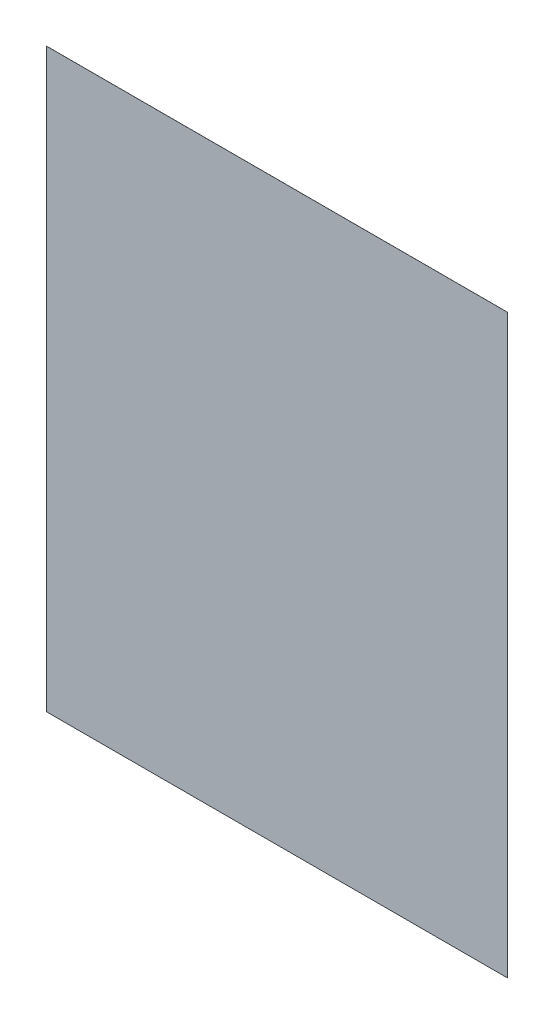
from build123d import *

# Parameters (mm, degrees)
SKETCH_1_W                           = 101.6
SKETCH_1_H                           = 127
SHEET_THICKNESS_10UM_REFERENCE_DEPTH = 0.01


with BuildPart() as part:
    # Sketch 1 → Sheet_thickness_10um_reference (new body)
    with BuildSketch(Plane.XY):
        Rectangle(SKETCH_1_W, SKETCH_1_H)
    extrude(amount=SHEET_THICKNESS_10UM_REFERENCE_DEPTH)


solid = part.part
